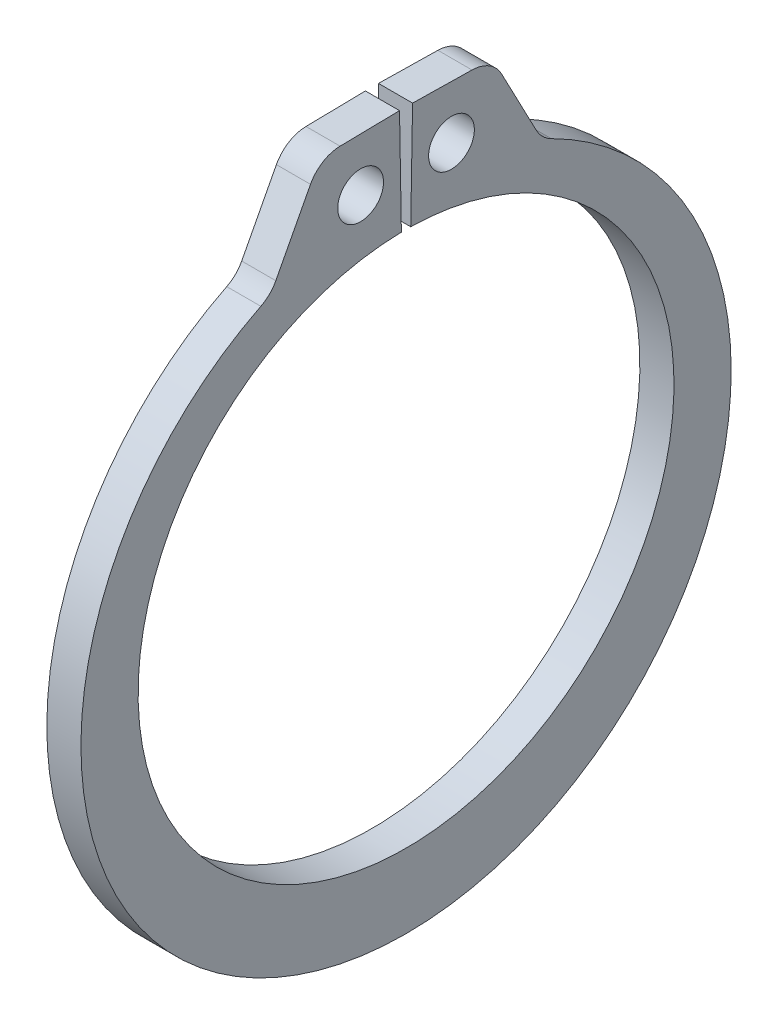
from build123d import *

# Parameters (mm, degrees)
SKETCH1_R      = 0.5969
EXTRUDE1_DEPTH = 0.4445
FILLET1_R      = 0.889


with BuildPart() as part:
    # Sketch1 → Extrude1 (new, symmetric)
    with BuildSketch(Plane(origin=(0, 0, 0), x_dir=(0, 0, -1), z_dir=(1, 0, 0))):
        with BuildLine():
            Line((-0.121905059, 6.983936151), (-0.170223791, 9.752114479))
            Line((-0.170223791, 9.752114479), (-2.246357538, 9.71587543))
            Line((-2.246357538, 9.71587543), (-3.532146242, 7.263959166))
            ThreePointArc((-3.532146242, 7.263959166), (0, -8.9154), (3.532146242, 7.263959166))
            Line((3.532146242, 7.263959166), (2.246357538, 9.71587543))
            Line((2.246357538, 9.71587543), (0.170223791, 9.752114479))
            Line((0.170223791, 9.752114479), (0.121905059, 6.983936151))
            ThreePointArc((0.121905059, 6.983936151), (0, -6.985), (-0.121905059, 6.983936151))
        make_face()
        with Locations((-1.184131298, 8.34990579)):
            Circle(SKETCH1_R, mode=Mode.SUBTRACT)
        with Locations((1.184131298, 8.34990579)):
            Circle(SKETCH1_R, mode=Mode.SUBTRACT)
    extrude(amount=EXTRUDE1_DEPTH, both=True)

    # Fillet1
    fillet1_edges = [part.edges().sort_by_distance(p)[0] for p in [
        (0, 9.71587543, -2.246357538),
        (0, 7.263959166, -3.532146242),
        (0, 7.263959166, 3.532146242),
        (0, 9.71587543, 2.246357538),
    ]]
    fillet(fillet1_edges, radius=FILLET1_R)


solid = part.part
